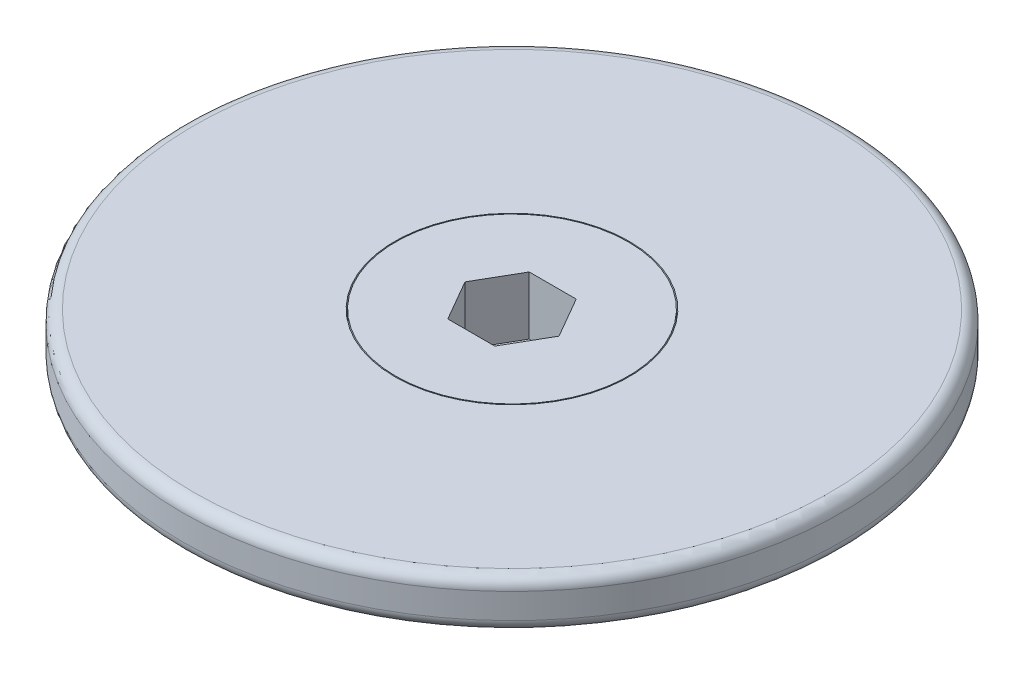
ISO-10303-21;
HEADER;
FILE_DESCRIPTION(('STEP AP214'),'2;1');
FILE_NAME('part.step','',(''),(''),'','','');
FILE_SCHEMA(('AUTOMOTIVE_DESIGN { 1 0 10303 214 1 1 1 1 }'));
ENDSEC;
DATA;
#1=APPLICATION_CONTEXT('core data for automotive mechanical design processes');
#2=APPLICATION_PROTOCOL_DEFINITION('international standard','automotive_design',2000,#1);
#3=PRODUCT_CONTEXT('',#1,'mechanical');
#4=PRODUCT('Part','Part','',(#3));
#5=PRODUCT_RELATED_PRODUCT_CATEGORY('part','',(#4));
#6=PRODUCT_DEFINITION_FORMATION('','',#4);
#7=PRODUCT_DEFINITION_CONTEXT('part definition',#1,'design');
#8=PRODUCT_DEFINITION('design','',#6,#7);
#9=PRODUCT_DEFINITION_SHAPE('','',#8);
#10=(LENGTH_UNIT() NAMED_UNIT(*) SI_UNIT(.MILLI.,.METRE.));
#11=(NAMED_UNIT(*) PLANE_ANGLE_UNIT() SI_UNIT($,.RADIAN.));
#12=(NAMED_UNIT(*) SI_UNIT($,.STERADIAN.) SOLID_ANGLE_UNIT());
#13=UNCERTAINTY_MEASURE_WITH_UNIT(LENGTH_MEASURE(1.E-05),#10,'distance_accuracy_value','');
#14=(GEOMETRIC_REPRESENTATION_CONTEXT(3) GLOBAL_UNCERTAINTY_ASSIGNED_CONTEXT((#13)) GLOBAL_UNIT_ASSIGNED_CONTEXT((#10,
#11,#12)) REPRESENTATION_CONTEXT('',''));
#15=CARTESIAN_POINT('',(0.,0.,0.));
#16=DIRECTION('',(0.,0.,1.));
#17=DIRECTION('',(1.,0.,0.));
#18=AXIS2_PLACEMENT_3D('',#15,#16,#17);
#19=CARTESIAN_POINT('',(0.,-1.5,0.));
#20=DIRECTION('',(0.,1.,0.));
#21=DIRECTION('',(0.,0.,1.));
#22=AXIS2_PLACEMENT_3D('',#19,#20,#21);
#23=CYLINDRICAL_SURFACE('',#22,6.);
#24=CARTESIAN_POINT('',(0.,-1.5,0.));
#25=DIRECTION('',(0.,1.,0.));
#26=DIRECTION('',(0.,0.,1.));
#27=AXIS2_PLACEMENT_3D('',#24,#25,#26);
#28=CIRCLE('',#27,6.);
#29=CARTESIAN_POINT('',(0.,-1.5,6.));
#30=VERTEX_POINT('',#29);
#31=EDGE_CURVE('E12',#30,#30,#28,.T.);
#32=ORIENTED_EDGE('',*,*,#31,.T.);
#33=EDGE_LOOP('',(#32));
#34=FACE_BOUND('',#33,.T.);
#35=CARTESIAN_POINT('',(0.,2.5,0.));
#36=DIRECTION('',(0.,1.,0.));
#37=DIRECTION('',(0.,0.,1.));
#38=AXIS2_PLACEMENT_3D('',#35,#36,#37);
#39=CIRCLE('',#38,6.);
#40=CARTESIAN_POINT('',(0.,2.5,6.));
#41=VERTEX_POINT('',#40);
#42=EDGE_CURVE('E46',#41,#41,#39,.T.);
#43=ORIENTED_EDGE('',*,*,#42,.F.);
#44=EDGE_LOOP('',(#43));
#45=FACE_BOUND('',#44,.T.);
#46=ADVANCED_FACE('F43',(#34,#45),#23,.T.);
#47=CARTESIAN_POINT('',(0.,-1.5,0.));
#48=DIRECTION('',(0.,1.,0.));
#49=DIRECTION('',(0.,0.,1.));
#50=AXIS2_PLACEMENT_3D('',#47,#48,#49);
#51=PLANE('',#50);
#52=ORIENTED_EDGE('',*,*,#31,.F.);
#53=EDGE_LOOP('',(#52));
#54=FACE_BOUND('',#53,.T.);
#55=ADVANCED_FACE('F168',(#54),#51,.F.);
#56=CARTESIAN_POINT('',(0.,2.5,0.));
#57=DIRECTION('',(0.,1.,0.));
#58=DIRECTION('',(0.,0.,1.));
#59=AXIS2_PLACEMENT_3D('',#56,#57,#58);
#60=PLANE('',#59);
#61=DIRECTION('',(1.,0.,0.));
#62=VECTOR('',#61,1.);
#63=CARTESIAN_POINT('',(-1.21243556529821,2.5,2.1));
#64=LINE('',#63,#62);
#65=CARTESIAN_POINT('',(-1.21243556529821,2.5,2.1));
#66=VERTEX_POINT('',#65);
#67=CARTESIAN_POINT('',(1.21243556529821,2.5,2.1));
#68=VERTEX_POINT('',#67);
#69=EDGE_CURVE('E57',#66,#68,#64,.T.);
#70=ORIENTED_EDGE('',*,*,#69,.F.);
#71=DIRECTION('',(0.5,0.,0.866025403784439));
#72=VECTOR('',#71,1.);
#73=CARTESIAN_POINT('',(-2.42487113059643,2.5,0.));
#74=LINE('',#73,#72);
#75=CARTESIAN_POINT('',(-2.42487113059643,2.5,0.));
#76=VERTEX_POINT('',#75);
#77=EDGE_CURVE('E140',#76,#66,#74,.T.);
#78=ORIENTED_EDGE('',*,*,#77,.F.);
#79=DIRECTION('',(-0.5,0.,0.866025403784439));
#80=VECTOR('',#79,1.);
#81=CARTESIAN_POINT('',(-1.21243556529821,2.5,-2.1));
#82=LINE('',#81,#80);
#83=CARTESIAN_POINT('',(-1.21243556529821,2.5,-2.1));
#84=VERTEX_POINT('',#83);
#85=EDGE_CURVE('E138',#84,#76,#82,.T.);
#86=ORIENTED_EDGE('',*,*,#85,.F.);
#87=DIRECTION('',(-1.,0.,0.));
#88=VECTOR('',#87,1.);
#89=CARTESIAN_POINT('',(1.21243556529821,2.5,-2.1));
#90=LINE('',#89,#88);
#91=CARTESIAN_POINT('',(1.21243556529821,2.5,-2.1));
#92=VERTEX_POINT('',#91);
#93=EDGE_CURVE('E105',#92,#84,#90,.T.);
#94=ORIENTED_EDGE('',*,*,#93,.F.);
#95=DIRECTION('',(-0.5,0.,-0.866025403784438));
#96=VECTOR('',#95,1.);
#97=CARTESIAN_POINT('',(2.42487113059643,2.5,0.));
#98=LINE('',#97,#96);
#99=CARTESIAN_POINT('',(2.42487113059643,2.5,0.));
#100=VERTEX_POINT('',#99);
#101=EDGE_CURVE('E134',#100,#92,#98,.T.);
#102=ORIENTED_EDGE('',*,*,#101,.F.);
#103=DIRECTION('',(0.5,0.,-0.866025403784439));
#104=VECTOR('',#103,1.);
#105=CARTESIAN_POINT('',(1.21243556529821,2.5,2.1));
#106=LINE('',#105,#104);
#107=EDGE_CURVE('E131',#68,#100,#106,.T.);
#108=ORIENTED_EDGE('',*,*,#107,.F.);
#109=EDGE_LOOP('',(#70,#78,#86,#94,#102,#108));
#110=FACE_BOUND('',#109,.T.);
#111=ORIENTED_EDGE('',*,*,#42,.T.);
#112=EDGE_LOOP('',(#111));
#113=FACE_BOUND('',#112,.T.);
#114=ADVANCED_FACE('F153',(#110,#113),#60,.T.);
#115=CARTESIAN_POINT('',(-1.21243556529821,-0.5,2.1));
#116=DIRECTION('',(0.,0.,1.));
#117=DIRECTION('',(1.,0.,0.));
#118=AXIS2_PLACEMENT_3D('',#115,#116,#117);
#119=PLANE('',#118);
#120=ORIENTED_EDGE('',*,*,#69,.T.);
#121=DIRECTION('',(0.,1.,0.));
#122=VECTOR('',#121,1.);
#123=CARTESIAN_POINT('',(1.21243556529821,-0.5,2.1));
#124=LINE('',#123,#122);
#125=CARTESIAN_POINT('',(1.21243556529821,-0.5,2.1));
#126=VERTEX_POINT('',#125);
#127=EDGE_CURVE('E87',#126,#68,#124,.T.);
#128=ORIENTED_EDGE('',*,*,#127,.F.);
#129=DIRECTION('',(1.,0.,0.));
#130=VECTOR('',#129,1.);
#131=CARTESIAN_POINT('',(-1.21243556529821,-0.5,2.1));
#132=LINE('',#131,#130);
#133=CARTESIAN_POINT('',(-1.21243556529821,-0.5,2.1));
#134=VERTEX_POINT('',#133);
#135=EDGE_CURVE('E142',#134,#126,#132,.T.);
#136=ORIENTED_EDGE('',*,*,#135,.F.);
#137=DIRECTION('',(0.,1.,0.));
#138=VECTOR('',#137,1.);
#139=CARTESIAN_POINT('',(-1.21243556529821,-0.5,2.1));
#140=LINE('',#139,#138);
#141=EDGE_CURVE('E65',#134,#66,#140,.T.);
#142=ORIENTED_EDGE('',*,*,#141,.T.);
#143=EDGE_LOOP('',(#120,#128,#136,#142));
#144=FACE_BOUND('',#143,.T.);
#145=ADVANCED_FACE('F159',(#144),#119,.F.);
#146=CARTESIAN_POINT('',(-2.42487113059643,-0.5,0.));
#147=DIRECTION('',(-0.866025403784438,0.,0.5));
#148=DIRECTION('',(0.5,0.,0.866025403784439));
#149=AXIS2_PLACEMENT_3D('',#146,#147,#148);
#150=PLANE('',#149);
#151=ORIENTED_EDGE('',*,*,#77,.T.);
#152=ORIENTED_EDGE('',*,*,#141,.F.);
#153=DIRECTION('',(0.5,0.,0.866025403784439));
#154=VECTOR('',#153,1.);
#155=CARTESIAN_POINT('',(-2.42487113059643,-0.5,0.));
#156=LINE('',#155,#154);
#157=CARTESIAN_POINT('',(-2.42487113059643,-0.5,0.));
#158=VERTEX_POINT('',#157);
#159=EDGE_CURVE('E117',#158,#134,#156,.T.);
#160=ORIENTED_EDGE('',*,*,#159,.F.);
#161=DIRECTION('',(0.,1.,0.));
#162=VECTOR('',#161,1.);
#163=CARTESIAN_POINT('',(-2.42487113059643,-0.5,0.));
#164=LINE('',#163,#162);
#165=EDGE_CURVE('E109',#158,#76,#164,.T.);
#166=ORIENTED_EDGE('',*,*,#165,.T.);
#167=EDGE_LOOP('',(#151,#152,#160,#166));
#168=FACE_BOUND('',#167,.T.);
#169=ADVANCED_FACE('F161',(#168),#150,.F.);
#170=CARTESIAN_POINT('',(-1.21243556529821,-0.5,-2.1));
#171=DIRECTION('',(-0.866025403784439,0.,-0.5));
#172=DIRECTION('',(-0.5,0.,0.866025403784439));
#173=AXIS2_PLACEMENT_3D('',#170,#171,#172);
#174=PLANE('',#173);
#175=ORIENTED_EDGE('',*,*,#85,.T.);
#176=ORIENTED_EDGE('',*,*,#165,.F.);
#177=DIRECTION('',(-0.5,0.,0.866025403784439));
#178=VECTOR('',#177,1.);
#179=CARTESIAN_POINT('',(-1.21243556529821,-0.5,-2.1));
#180=LINE('',#179,#178);
#181=CARTESIAN_POINT('',(-1.21243556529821,-0.5,-2.1));
#182=VERTEX_POINT('',#181);
#183=EDGE_CURVE('E113',#182,#158,#180,.T.);
#184=ORIENTED_EDGE('',*,*,#183,.F.);
#185=DIRECTION('',(0.,1.,0.));
#186=VECTOR('',#185,1.);
#187=CARTESIAN_POINT('',(-1.21243556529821,-0.5,-2.1));
#188=LINE('',#187,#186);
#189=EDGE_CURVE('E98',#182,#84,#188,.T.);
#190=ORIENTED_EDGE('',*,*,#189,.T.);
#191=EDGE_LOOP('',(#175,#176,#184,#190));
#192=FACE_BOUND('',#191,.T.);
#193=ADVANCED_FACE('F114',(#192),#174,.F.);
#194=CARTESIAN_POINT('',(1.21243556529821,-0.5,-2.1));
#195=DIRECTION('',(0.,0.,-1.));
#196=DIRECTION('',(-1.,0.,0.));
#197=AXIS2_PLACEMENT_3D('',#194,#195,#196);
#198=PLANE('',#197);
#199=ORIENTED_EDGE('',*,*,#93,.T.);
#200=ORIENTED_EDGE('',*,*,#189,.F.);
#201=DIRECTION('',(-1.,0.,0.));
#202=VECTOR('',#201,1.);
#203=CARTESIAN_POINT('',(1.21243556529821,-0.5,-2.1));
#204=LINE('',#203,#202);
#205=CARTESIAN_POINT('',(1.21243556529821,-0.5,-2.1));
#206=VERTEX_POINT('',#205);
#207=EDGE_CURVE('E102',#206,#182,#204,.T.);
#208=ORIENTED_EDGE('',*,*,#207,.F.);
#209=DIRECTION('',(0.,1.,0.));
#210=VECTOR('',#209,1.);
#211=CARTESIAN_POINT('',(1.21243556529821,-0.5,-2.1));
#212=LINE('',#211,#210);
#213=EDGE_CURVE('E110',#206,#92,#212,.T.);
#214=ORIENTED_EDGE('',*,*,#213,.T.);
#215=EDGE_LOOP('',(#199,#200,#208,#214));
#216=FACE_BOUND('',#215,.T.);
#217=ADVANCED_FACE('F100',(#216),#198,.F.);
#218=CARTESIAN_POINT('',(2.42487113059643,-0.5,0.));
#219=DIRECTION('',(0.866025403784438,0.,-0.5));
#220=DIRECTION('',(-0.5,0.,-0.866025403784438));
#221=AXIS2_PLACEMENT_3D('',#218,#219,#220);
#222=PLANE('',#221);
#223=ORIENTED_EDGE('',*,*,#101,.T.);
#224=ORIENTED_EDGE('',*,*,#213,.F.);
#225=DIRECTION('',(-0.5,0.,-0.866025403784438));
#226=VECTOR('',#225,1.);
#227=CARTESIAN_POINT('',(2.42487113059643,-0.5,0.));
#228=LINE('',#227,#226);
#229=CARTESIAN_POINT('',(2.42487113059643,-0.5,0.));
#230=VERTEX_POINT('',#229);
#231=EDGE_CURVE('E123',#230,#206,#228,.T.);
#232=ORIENTED_EDGE('',*,*,#231,.F.);
#233=DIRECTION('',(0.,1.,0.));
#234=VECTOR('',#233,1.);
#235=CARTESIAN_POINT('',(2.42487113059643,-0.5,0.));
#236=LINE('',#235,#234);
#237=EDGE_CURVE('E146',#230,#100,#236,.T.);
#238=ORIENTED_EDGE('',*,*,#237,.T.);
#239=EDGE_LOOP('',(#223,#224,#232,#238));
#240=FACE_BOUND('',#239,.T.);
#241=ADVANCED_FACE('F157',(#240),#222,.F.);
#242=CARTESIAN_POINT('',(1.21243556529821,-0.5,2.1));
#243=DIRECTION('',(0.866025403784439,0.,0.5));
#244=DIRECTION('',(0.5,0.,-0.866025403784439));
#245=AXIS2_PLACEMENT_3D('',#242,#243,#244);
#246=PLANE('',#245);
#247=ORIENTED_EDGE('',*,*,#107,.T.);
#248=ORIENTED_EDGE('',*,*,#237,.F.);
#249=DIRECTION('',(0.5,0.,-0.866025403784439));
#250=VECTOR('',#249,1.);
#251=CARTESIAN_POINT('',(1.21243556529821,-0.5,2.1));
#252=LINE('',#251,#250);
#253=EDGE_CURVE('E125',#126,#230,#252,.T.);
#254=ORIENTED_EDGE('',*,*,#253,.F.);
#255=ORIENTED_EDGE('',*,*,#127,.T.);
#256=EDGE_LOOP('',(#247,#248,#254,#255));
#257=FACE_BOUND('',#256,.T.);
#258=ADVANCED_FACE('F150',(#257),#246,.F.);
#259=CARTESIAN_POINT('',(0.,-0.5,0.));
#260=DIRECTION('',(0.,1.,0.));
#261=DIRECTION('',(0.,0.,1.));
#262=AXIS2_PLACEMENT_3D('',#259,#260,#261);
#263=PLANE('',#262);
#264=ORIENTED_EDGE('',*,*,#135,.T.);
#265=ORIENTED_EDGE('',*,*,#253,.T.);
#266=ORIENTED_EDGE('',*,*,#231,.T.);
#267=ORIENTED_EDGE('',*,*,#207,.T.);
#268=ORIENTED_EDGE('',*,*,#183,.T.);
#269=ORIENTED_EDGE('',*,*,#159,.T.);
#270=EDGE_LOOP('',(#264,#265,#266,#267,#268,#269));
#271=FACE_BOUND('',#270,.T.);
#272=ADVANCED_FACE('F120',(#271),#263,.T.);
#273=CLOSED_SHELL('',(#46,#55,#114,#145,#169,#193,#217,#241,#258,#272));
#274=MANIFOLD_SOLID_BREP('B2',#273);
#275=CARTESIAN_POINT('',(0.,2.5,0.));
#276=DIRECTION('',(0.,1.,0.));
#277=DIRECTION('',(0.,0.,1.));
#278=AXIS2_PLACEMENT_3D('',#275,#276,#277);
#279=PLANE('',#278);
#280=CARTESIAN_POINT('',(0.,2.5,0.));
#281=DIRECTION('',(0.,1.,0.));
#282=DIRECTION('',(0.,0.,1.));
#283=AXIS2_PLACEMENT_3D('',#280,#281,#282);
#284=CIRCLE('',#283,16.4);
#285=CARTESIAN_POINT('',(0.,2.5,16.4));
#286=VERTEX_POINT('',#285);
#287=EDGE_CURVE('E42',#286,#286,#284,.T.);
#288=ORIENTED_EDGE('',*,*,#287,.T.);
#289=EDGE_LOOP('',(#288));
#290=FACE_BOUND('',#289,.T.);
#291=CARTESIAN_POINT('',(0.,2.5,0.));
#292=DIRECTION('',(0.,1.,0.));
#293=DIRECTION('',(0.,0.,1.));
#294=AXIS2_PLACEMENT_3D('',#291,#292,#293);
#295=CIRCLE('',#294,6.05);
#296=CARTESIAN_POINT('',(0.,2.5,6.05));
#297=VERTEX_POINT('',#296);
#298=EDGE_CURVE('E269',#297,#297,#295,.T.);
#299=ORIENTED_EDGE('',*,*,#298,.F.);
#300=EDGE_LOOP('',(#299));
#301=FACE_BOUND('',#300,.T.);
#302=ADVANCED_FACE('F249',(#290,#301),#279,.T.);
#303=CARTESIAN_POINT('',(0.,0.,0.));
#304=DIRECTION('',(0.,1.,0.));
#305=DIRECTION('',(0.,0.,1.));
#306=AXIS2_PLACEMENT_3D('',#303,#304,#305);
#307=PLANE('',#306);
#308=CARTESIAN_POINT('',(0.,0.,0.));
#309=DIRECTION('',(0.,1.,0.));
#310=DIRECTION('',(0.,0.,1.));
#311=AXIS2_PLACEMENT_3D('',#308,#309,#310);
#312=CIRCLE('',#311,16.4);
#313=CARTESIAN_POINT('',(0.,0.,16.4));
#314=VERTEX_POINT('',#313);
#315=EDGE_CURVE('E256',#314,#314,#312,.F.);
#316=ORIENTED_EDGE('',*,*,#315,.T.);
#317=EDGE_LOOP('',(#316));
#318=FACE_BOUND('',#317,.T.);
#319=CARTESIAN_POINT('',(0.,0.,0.));
#320=DIRECTION('',(0.,1.,0.));
#321=DIRECTION('',(0.,0.,1.));
#322=AXIS2_PLACEMENT_3D('',#319,#320,#321);
#323=CIRCLE('',#322,6.05);
#324=CARTESIAN_POINT('',(0.,0.,6.05));
#325=VERTEX_POINT('',#324);
#326=EDGE_CURVE('E270',#325,#325,#323,.T.);
#327=ORIENTED_EDGE('',*,*,#326,.T.);
#328=EDGE_LOOP('',(#327));
#329=FACE_BOUND('',#328,.T.);
#330=ADVANCED_FACE('F280',(#318,#329),#307,.F.);
#331=CARTESIAN_POINT('',(0.,2.5,0.));
#332=DIRECTION('',(0.,-1.,0.));
#333=DIRECTION('',(0.,0.,-1.));
#334=AXIS2_PLACEMENT_3D('',#331,#332,#333);
#335=CYLINDRICAL_SURFACE('',#334,17.);
#336=CARTESIAN_POINT('',(0.,0.6,0.));
#337=DIRECTION('',(0.,1.,0.));
#338=DIRECTION('',(0.,0.,1.));
#339=AXIS2_PLACEMENT_3D('',#336,#337,#338);
#340=CIRCLE('',#339,17.);
#341=CARTESIAN_POINT('',(0.,0.6,17.));
#342=VERTEX_POINT('',#341);
#343=EDGE_CURVE('E260',#342,#342,#340,.T.);
#344=ORIENTED_EDGE('',*,*,#343,.T.);
#345=EDGE_LOOP('',(#344));
#346=FACE_BOUND('',#345,.T.);
#347=CARTESIAN_POINT('',(0.,1.9,0.));
#348=DIRECTION('',(0.,1.,0.));
#349=DIRECTION('',(0.,0.,1.));
#350=AXIS2_PLACEMENT_3D('',#347,#348,#349);
#351=CIRCLE('',#350,17.);
#352=CARTESIAN_POINT('',(0.,1.9,17.));
#353=VERTEX_POINT('',#352);
#354=EDGE_CURVE('E264',#353,#353,#351,.F.);
#355=ORIENTED_EDGE('',*,*,#354,.T.);
#356=EDGE_LOOP('',(#355));
#357=FACE_BOUND('',#356,.T.);
#358=ADVANCED_FACE('F285',(#346,#357),#335,.T.);
#359=CARTESIAN_POINT('',(0.,2.5,0.));
#360=DIRECTION('',(0.,-1.,0.));
#361=DIRECTION('',(0.,0.,-1.));
#362=AXIS2_PLACEMENT_3D('',#359,#360,#361);
#363=CYLINDRICAL_SURFACE('',#362,6.05);
#364=ORIENTED_EDGE('',*,*,#298,.T.);
#365=EDGE_LOOP('',(#364));
#366=FACE_BOUND('',#365,.T.);
#367=ORIENTED_EDGE('',*,*,#326,.F.);
#368=EDGE_LOOP('',(#367));
#369=FACE_BOUND('',#368,.T.);
#370=ADVANCED_FACE('F276',(#366,#369),#363,.F.);
#371=CARTESIAN_POINT('',(0.,0.6,0.));
#372=DIRECTION('',(0.,1.,0.));
#373=DIRECTION('',(0.,0.,1.));
#374=AXIS2_PLACEMENT_3D('',#371,#372,#373);
#375=TOROIDAL_SURFACE('',#374,16.4,0.6);
#376=ORIENTED_EDGE('',*,*,#315,.F.);
#377=EDGE_LOOP('',(#376));
#378=FACE_BOUND('',#377,.T.);
#379=ORIENTED_EDGE('',*,*,#343,.F.);
#380=EDGE_LOOP('',(#379));
#381=FACE_BOUND('',#380,.T.);
#382=ADVANCED_FACE('F291',(#378,#381),#375,.T.);
#383=CARTESIAN_POINT('',(0.,1.9,0.));
#384=DIRECTION('',(0.,1.,0.));
#385=DIRECTION('',(0.,0.,1.));
#386=AXIS2_PLACEMENT_3D('',#383,#384,#385);
#387=TOROIDAL_SURFACE('',#386,16.4,0.6);
#388=ORIENTED_EDGE('',*,*,#354,.F.);
#389=EDGE_LOOP('',(#388));
#390=FACE_BOUND('',#389,.T.);
#391=ORIENTED_EDGE('',*,*,#287,.F.);
#392=EDGE_LOOP('',(#391));
#393=FACE_BOUND('',#392,.T.);
#394=ADVANCED_FACE('F251',(#390,#393),#387,.T.);
#395=CLOSED_SHELL('',(#302,#330,#358,#370,#382,#394));
#396=MANIFOLD_SOLID_BREP('B6',#395);
#397=ADVANCED_BREP_SHAPE_REPRESENTATION('',(#18,#274,#396),#14);
#398=SHAPE_DEFINITION_REPRESENTATION(#9,#397);
ENDSEC;
END-ISO-10303-21;
